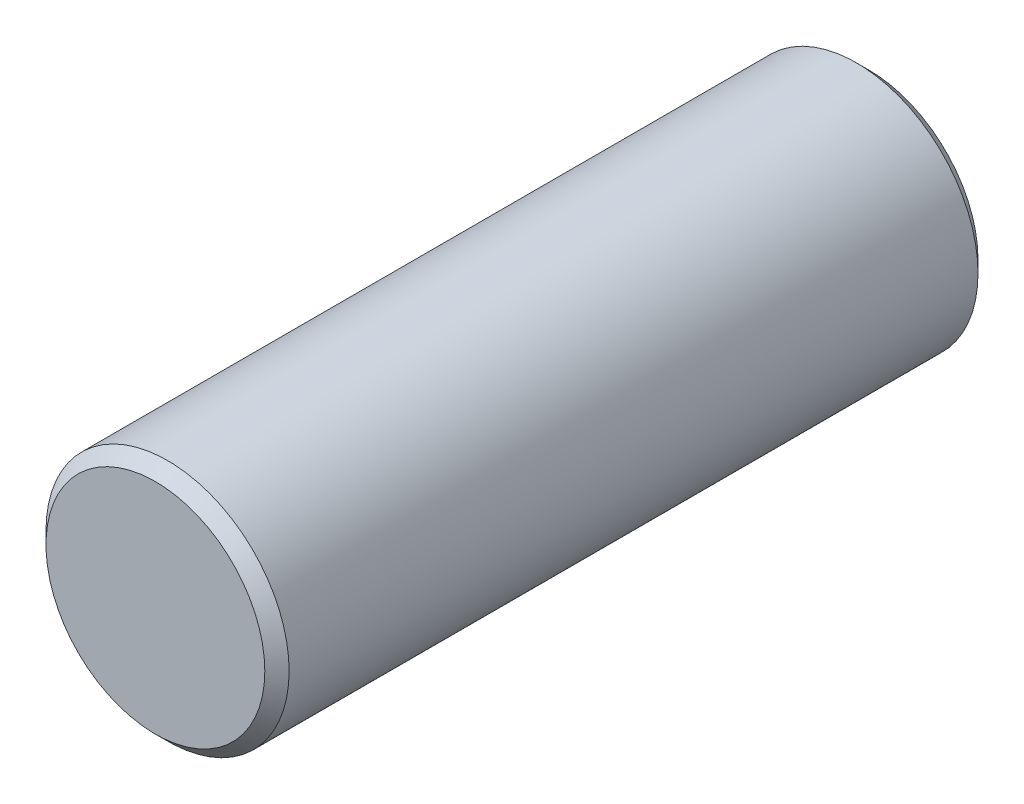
ISO-10303-21;
HEADER;
FILE_DESCRIPTION(('STEP AP214'),'2;1');
FILE_NAME('part.step','',(''),(''),'','','');
FILE_SCHEMA(('AUTOMOTIVE_DESIGN { 1 0 10303 214 1 1 1 1 }'));
ENDSEC;
DATA;
#1=APPLICATION_CONTEXT('core data for automotive mechanical design processes');
#2=APPLICATION_PROTOCOL_DEFINITION('international standard','automotive_design',2000,#1);
#3=PRODUCT_CONTEXT('',#1,'mechanical');
#4=PRODUCT('Part','Part','',(#3));
#5=PRODUCT_RELATED_PRODUCT_CATEGORY('part','',(#4));
#6=PRODUCT_DEFINITION_FORMATION('','',#4);
#7=PRODUCT_DEFINITION_CONTEXT('part definition',#1,'design');
#8=PRODUCT_DEFINITION('design','',#6,#7);
#9=PRODUCT_DEFINITION_SHAPE('','',#8);
#10=(LENGTH_UNIT() NAMED_UNIT(*) SI_UNIT(.MILLI.,.METRE.));
#11=(NAMED_UNIT(*) PLANE_ANGLE_UNIT() SI_UNIT($,.RADIAN.));
#12=(NAMED_UNIT(*) SI_UNIT($,.STERADIAN.) SOLID_ANGLE_UNIT());
#13=UNCERTAINTY_MEASURE_WITH_UNIT(LENGTH_MEASURE(1.E-05),#10,'distance_accuracy_value','');
#14=(GEOMETRIC_REPRESENTATION_CONTEXT(3) GLOBAL_UNCERTAINTY_ASSIGNED_CONTEXT((#13)) GLOBAL_UNIT_ASSIGNED_CONTEXT((#10,
#11,#12)) REPRESENTATION_CONTEXT('',''));
#15=CARTESIAN_POINT('',(0.,0.,0.));
#16=DIRECTION('',(0.,0.,1.));
#17=DIRECTION('',(1.,0.,0.));
#18=AXIS2_PLACEMENT_3D('',#15,#16,#17);
#19=CARTESIAN_POINT('',(0.,0.,88.));
#20=DIRECTION('',(0.,0.,-1.));
#21=DIRECTION('',(-1.,0.,0.));
#22=AXIS2_PLACEMENT_3D('',#19,#20,#21);
#23=CYLINDRICAL_SURFACE('',#22,15.);
#24=CARTESIAN_POINT('',(0.,0.,1.50000000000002));
#25=DIRECTION('',(0.,0.,1.));
#26=DIRECTION('',(1.,0.,0.));
#27=AXIS2_PLACEMENT_3D('',#24,#25,#26);
#28=CIRCLE('',#27,15.);
#29=CARTESIAN_POINT('',(15.,0.,1.50000000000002));
#30=VERTEX_POINT('',#29);
#31=EDGE_CURVE('E44',#30,#30,#28,.T.);
#32=ORIENTED_EDGE('',*,*,#31,.T.);
#33=EDGE_LOOP('',(#32));
#34=FACE_BOUND('',#33,.T.);
#35=CARTESIAN_POINT('',(0.,0.,86.5));
#36=DIRECTION('',(0.,0.,1.));
#37=DIRECTION('',(1.,0.,0.));
#38=AXIS2_PLACEMENT_3D('',#35,#36,#37);
#39=CIRCLE('',#38,15.);
#40=CARTESIAN_POINT('',(15.,0.,86.5));
#41=VERTEX_POINT('',#40);
#42=EDGE_CURVE('E48',#41,#41,#39,.F.);
#43=ORIENTED_EDGE('',*,*,#42,.T.);
#44=EDGE_LOOP('',(#43));
#45=FACE_BOUND('',#44,.T.);
#46=ADVANCED_FACE('F34',(#34,#45),#23,.T.);
#47=CARTESIAN_POINT('',(0.,0.,88.));
#48=DIRECTION('',(0.,0.,1.));
#49=DIRECTION('',(1.,0.,0.));
#50=AXIS2_PLACEMENT_3D('',#47,#48,#49);
#51=PLANE('',#50);
#52=CARTESIAN_POINT('',(0.,0.,88.));
#53=DIRECTION('',(0.,0.,1.));
#54=DIRECTION('',(1.,0.,0.));
#55=AXIS2_PLACEMENT_3D('',#52,#53,#54);
#56=CIRCLE('',#55,13.5);
#57=CARTESIAN_POINT('',(13.5,0.,88.));
#58=VERTEX_POINT('',#57);
#59=EDGE_CURVE('E10',#58,#58,#56,.T.);
#60=ORIENTED_EDGE('',*,*,#59,.T.);
#61=EDGE_LOOP('',(#60));
#62=FACE_BOUND('',#61,.T.);
#63=ADVANCED_FACE('F67',(#62),#51,.T.);
#64=CARTESIAN_POINT('',(0.,0.,0.));
#65=DIRECTION('',(0.,0.,1.));
#66=DIRECTION('',(1.,0.,0.));
#67=AXIS2_PLACEMENT_3D('',#64,#65,#66);
#68=PLANE('',#67);
#69=CARTESIAN_POINT('',(0.,0.,0.));
#70=DIRECTION('',(0.,0.,1.));
#71=DIRECTION('',(1.,0.,0.));
#72=AXIS2_PLACEMENT_3D('',#69,#70,#71);
#73=CIRCLE('',#72,13.5);
#74=CARTESIAN_POINT('',(13.5,0.,0.));
#75=VERTEX_POINT('',#74);
#76=EDGE_CURVE('E40',#75,#75,#73,.F.);
#77=ORIENTED_EDGE('',*,*,#76,.T.);
#78=EDGE_LOOP('',(#77));
#79=FACE_BOUND('',#78,.T.);
#80=ADVANCED_FACE('F63',(#79),#68,.F.);
#81=CARTESIAN_POINT('',(0.,0.,1.50000000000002));
#82=DIRECTION('',(0.,0.,1.));
#83=DIRECTION('',(1.,0.,0.));
#84=AXIS2_PLACEMENT_3D('',#81,#82,#83);
#85=CONICAL_SURFACE('',#84,15.,0.785398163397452);
#86=ORIENTED_EDGE('',*,*,#76,.F.);
#87=EDGE_LOOP('',(#86));
#88=FACE_BOUND('',#87,.T.);
#89=ORIENTED_EDGE('',*,*,#31,.F.);
#90=EDGE_LOOP('',(#89));
#91=FACE_BOUND('',#90,.T.);
#92=ADVANCED_FACE('F58',(#88,#91),#85,.T.);
#93=CARTESIAN_POINT('',(0.,0.,88.));
#94=DIRECTION('',(0.,0.,-1.));
#95=DIRECTION('',(-1.,0.,0.));
#96=AXIS2_PLACEMENT_3D('',#93,#94,#95);
#97=CONICAL_SURFACE('',#96,13.5,0.785398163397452);
#98=ORIENTED_EDGE('',*,*,#42,.F.);
#99=EDGE_LOOP('',(#98));
#100=FACE_BOUND('',#99,.T.);
#101=ORIENTED_EDGE('',*,*,#59,.F.);
#102=EDGE_LOOP('',(#101));
#103=FACE_BOUND('',#102,.T.);
#104=ADVANCED_FACE('F55',(#100,#103),#97,.T.);
#105=CLOSED_SHELL('',(#46,#63,#80,#92,#104));
#106=MANIFOLD_SOLID_BREP('B2',#105);
#107=ADVANCED_BREP_SHAPE_REPRESENTATION('',(#18,#106),#14);
#108=SHAPE_DEFINITION_REPRESENTATION(#9,#107);
ENDSEC;
END-ISO-10303-21;
